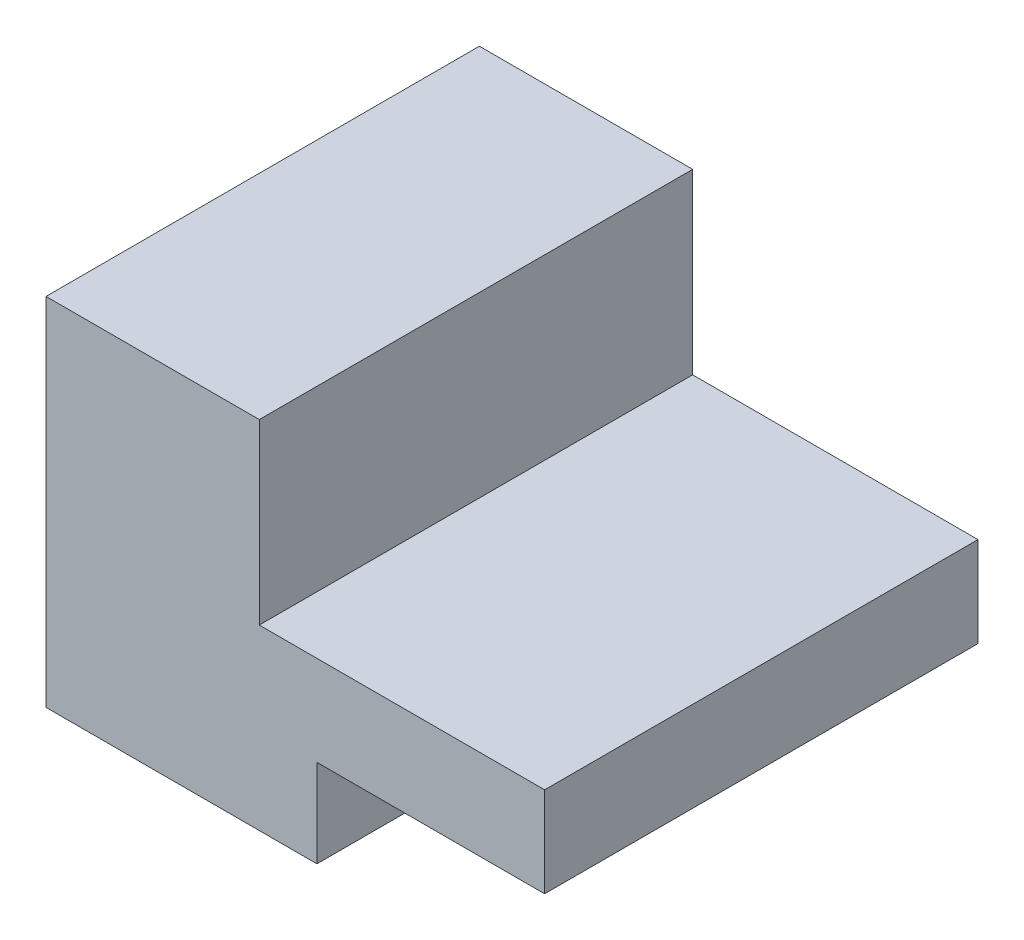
ISO-10303-21;
HEADER;
FILE_DESCRIPTION(('STEP AP214'),'2;1');
FILE_NAME('part.step','',(''),(''),'','','');
FILE_SCHEMA(('AUTOMOTIVE_DESIGN { 1 0 10303 214 1 1 1 1 }'));
ENDSEC;
DATA;
#1=APPLICATION_CONTEXT('core data for automotive mechanical design processes');
#2=APPLICATION_PROTOCOL_DEFINITION('international standard','automotive_design',2000,#1);
#3=PRODUCT_CONTEXT('',#1,'mechanical');
#4=PRODUCT('Part','Part','',(#3));
#5=PRODUCT_RELATED_PRODUCT_CATEGORY('part','',(#4));
#6=PRODUCT_DEFINITION_FORMATION('','',#4);
#7=PRODUCT_DEFINITION_CONTEXT('part definition',#1,'design');
#8=PRODUCT_DEFINITION('design','',#6,#7);
#9=PRODUCT_DEFINITION_SHAPE('','',#8);
#10=(LENGTH_UNIT() NAMED_UNIT(*) SI_UNIT(.MILLI.,.METRE.));
#11=(NAMED_UNIT(*) PLANE_ANGLE_UNIT() SI_UNIT($,.RADIAN.));
#12=(NAMED_UNIT(*) SI_UNIT($,.STERADIAN.) SOLID_ANGLE_UNIT());
#13=UNCERTAINTY_MEASURE_WITH_UNIT(LENGTH_MEASURE(1.E-05),#10,'distance_accuracy_value','');
#14=(GEOMETRIC_REPRESENTATION_CONTEXT(3) GLOBAL_UNCERTAINTY_ASSIGNED_CONTEXT((#13)) GLOBAL_UNIT_ASSIGNED_CONTEXT((#10,
#11,#12)) REPRESENTATION_CONTEXT('',''));
#15=CARTESIAN_POINT('',(0.,0.,0.));
#16=DIRECTION('',(0.,0.,1.));
#17=DIRECTION('',(1.,0.,0.));
#18=AXIS2_PLACEMENT_3D('',#15,#16,#17);
#19=CARTESIAN_POINT('',(-6.70357815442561,0.,42.));
#20=DIRECTION('',(0.,1.,0.));
#21=DIRECTION('',(0.,0.,1.));
#22=AXIS2_PLACEMENT_3D('',#19,#20,#21);
#23=PLANE('',#22);
#24=DIRECTION('',(1.,0.,0.));
#25=VECTOR('',#24,1.);
#26=CARTESIAN_POINT('',(-6.70357815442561,0.,0.));
#27=LINE('',#26,#25);
#28=CARTESIAN_POINT('',(-32.9592592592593,0.,0.));
#29=VERTEX_POINT('',#28);
#30=CARTESIAN_POINT('',(-6.70357815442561,0.,0.));
#31=VERTEX_POINT('',#30);
#32=EDGE_CURVE('E94',#29,#31,#27,.T.);
#33=ORIENTED_EDGE('',*,*,#32,.T.);
#34=DIRECTION('',(0.,0.,-1.));
#35=VECTOR('',#34,1.);
#36=CARTESIAN_POINT('',(-6.70357815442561,0.,42.));
#37=LINE('',#36,#35);
#38=CARTESIAN_POINT('',(-6.70357815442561,0.,42.));
#39=VERTEX_POINT('',#38);
#40=EDGE_CURVE('E11',#39,#31,#37,.T.);
#41=ORIENTED_EDGE('',*,*,#40,.F.);
#42=DIRECTION('',(1.,0.,0.));
#43=VECTOR('',#42,1.);
#44=CARTESIAN_POINT('',(-6.70357815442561,0.,42.));
#45=LINE('',#44,#43);
#46=CARTESIAN_POINT('',(-32.9592592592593,0.,42.));
#47=VERTEX_POINT('',#46);
#48=EDGE_CURVE('E121',#47,#39,#45,.T.);
#49=ORIENTED_EDGE('',*,*,#48,.F.);
#50=DIRECTION('',(0.,0.,-1.));
#51=VECTOR('',#50,1.);
#52=CARTESIAN_POINT('',(-32.9592592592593,0.,42.));
#53=LINE('',#52,#51);
#54=EDGE_CURVE('E107',#47,#29,#53,.T.);
#55=ORIENTED_EDGE('',*,*,#54,.T.);
#56=EDGE_LOOP('',(#33,#41,#49,#55));
#57=FACE_BOUND('',#56,.T.);
#58=ADVANCED_FACE('F26',(#57),#23,.F.);
#59=CARTESIAN_POINT('',(-6.70357815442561,8.51913057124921,42.));
#60=DIRECTION('',(-1.,0.,0.));
#61=DIRECTION('',(0.,0.,1.));
#62=AXIS2_PLACEMENT_3D('',#59,#60,#61);
#63=PLANE('',#62);
#64=DIRECTION('',(0.,1.,0.));
#65=VECTOR('',#64,1.);
#66=CARTESIAN_POINT('',(-6.70357815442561,8.51913057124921,0.));
#67=LINE('',#66,#65);
#68=CARTESIAN_POINT('',(-6.70357815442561,8.51913057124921,0.));
#69=VERTEX_POINT('',#68);
#70=EDGE_CURVE('E90',#31,#69,#67,.T.);
#71=ORIENTED_EDGE('',*,*,#70,.T.);
#72=DIRECTION('',(0.,0.,-1.));
#73=VECTOR('',#72,1.);
#74=CARTESIAN_POINT('',(-6.70357815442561,8.51913057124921,42.));
#75=LINE('',#74,#73);
#76=CARTESIAN_POINT('',(-6.70357815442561,8.51913057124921,42.));
#77=VERTEX_POINT('',#76);
#78=EDGE_CURVE('E33',#77,#69,#75,.T.);
#79=ORIENTED_EDGE('',*,*,#78,.F.);
#80=DIRECTION('',(0.,1.,0.));
#81=VECTOR('',#80,1.);
#82=CARTESIAN_POINT('',(-6.70357815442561,8.51913057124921,42.));
#83=LINE('',#82,#81);
#84=EDGE_CURVE('E103',#39,#77,#83,.T.);
#85=ORIENTED_EDGE('',*,*,#84,.F.);
#86=ORIENTED_EDGE('',*,*,#40,.T.);
#87=EDGE_LOOP('',(#71,#79,#85,#86));
#88=FACE_BOUND('',#87,.T.);
#89=ADVANCED_FACE('F102',(#88),#63,.F.);
#90=CARTESIAN_POINT('',(15.362366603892,8.51913057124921,42.));
#91=DIRECTION('',(0.,1.,0.));
#92=DIRECTION('',(0.,0.,1.));
#93=AXIS2_PLACEMENT_3D('',#90,#91,#92);
#94=PLANE('',#93);
#95=DIRECTION('',(1.,0.,0.));
#96=VECTOR('',#95,1.);
#97=CARTESIAN_POINT('',(15.362366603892,8.51913057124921,0.));
#98=LINE('',#97,#96);
#99=CARTESIAN_POINT('',(15.362366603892,8.51913057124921,0.));
#100=VERTEX_POINT('',#99);
#101=EDGE_CURVE('E96',#69,#100,#98,.T.);
#102=ORIENTED_EDGE('',*,*,#101,.T.);
#103=DIRECTION('',(0.,0.,-1.));
#104=VECTOR('',#103,1.);
#105=CARTESIAN_POINT('',(15.362366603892,8.51913057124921,42.));
#106=LINE('',#105,#104);
#107=CARTESIAN_POINT('',(15.362366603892,8.51913057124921,42.));
#108=VERTEX_POINT('',#107);
#109=EDGE_CURVE('E147',#108,#100,#106,.T.);
#110=ORIENTED_EDGE('',*,*,#109,.F.);
#111=DIRECTION('',(1.,0.,0.));
#112=VECTOR('',#111,1.);
#113=CARTESIAN_POINT('',(15.362366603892,8.51913057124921,42.));
#114=LINE('',#113,#112);
#115=EDGE_CURVE('E124',#77,#108,#114,.T.);
#116=ORIENTED_EDGE('',*,*,#115,.F.);
#117=ORIENTED_EDGE('',*,*,#78,.T.);
#118=EDGE_LOOP('',(#102,#110,#116,#117));
#119=FACE_BOUND('',#118,.T.);
#120=ADVANCED_FACE('F151',(#119),#94,.F.);
#121=CARTESIAN_POINT('',(15.362366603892,17.2477479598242,42.));
#122=DIRECTION('',(-1.,0.,0.));
#123=DIRECTION('',(0.,0.,1.));
#124=AXIS2_PLACEMENT_3D('',#121,#122,#123);
#125=PLANE('',#124);
#126=DIRECTION('',(0.,1.,0.));
#127=VECTOR('',#126,1.);
#128=CARTESIAN_POINT('',(15.362366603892,17.2477479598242,0.));
#129=LINE('',#128,#127);
#130=CARTESIAN_POINT('',(15.362366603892,17.2477479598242,0.));
#131=VERTEX_POINT('',#130);
#132=EDGE_CURVE('E111',#100,#131,#129,.T.);
#133=ORIENTED_EDGE('',*,*,#132,.T.);
#134=DIRECTION('',(0.,0.,-1.));
#135=VECTOR('',#134,1.);
#136=CARTESIAN_POINT('',(15.362366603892,17.2477479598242,42.));
#137=LINE('',#136,#135);
#138=CARTESIAN_POINT('',(15.362366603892,17.2477479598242,42.));
#139=VERTEX_POINT('',#138);
#140=EDGE_CURVE('E144',#139,#131,#137,.T.);
#141=ORIENTED_EDGE('',*,*,#140,.F.);
#142=DIRECTION('',(0.,1.,0.));
#143=VECTOR('',#142,1.);
#144=CARTESIAN_POINT('',(15.362366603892,17.2477479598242,42.));
#145=LINE('',#144,#143);
#146=EDGE_CURVE('E126',#108,#139,#145,.T.);
#147=ORIENTED_EDGE('',*,*,#146,.F.);
#148=ORIENTED_EDGE('',*,*,#109,.T.);
#149=EDGE_LOOP('',(#133,#141,#147,#148));
#150=FACE_BOUND('',#149,.T.);
#151=ADVANCED_FACE('F159',(#150),#125,.F.);
#152=CARTESIAN_POINT('',(-12.2898932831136,17.2477479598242,42.));
#153=DIRECTION('',(0.,-1.,0.));
#154=DIRECTION('',(0.,0.,-1.));
#155=AXIS2_PLACEMENT_3D('',#152,#153,#154);
#156=PLANE('',#155);
#157=DIRECTION('',(-1.,0.,0.));
#158=VECTOR('',#157,1.);
#159=CARTESIAN_POINT('',(-12.2898932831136,17.2477479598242,0.));
#160=LINE('',#159,#158);
#161=CARTESIAN_POINT('',(-12.2898932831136,17.2477479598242,0.));
#162=VERTEX_POINT('',#161);
#163=EDGE_CURVE('E113',#131,#162,#160,.T.);
#164=ORIENTED_EDGE('',*,*,#163,.T.);
#165=DIRECTION('',(0.,0.,-1.));
#166=VECTOR('',#165,1.);
#167=CARTESIAN_POINT('',(-12.2898932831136,17.2477479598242,42.));
#168=LINE('',#167,#166);
#169=CARTESIAN_POINT('',(-12.2898932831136,17.2477479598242,42.));
#170=VERTEX_POINT('',#169);
#171=EDGE_CURVE('E141',#170,#162,#168,.T.);
#172=ORIENTED_EDGE('',*,*,#171,.F.);
#173=DIRECTION('',(-1.,0.,0.));
#174=VECTOR('',#173,1.);
#175=CARTESIAN_POINT('',(-12.2898932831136,17.2477479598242,42.));
#176=LINE('',#175,#174);
#177=EDGE_CURVE('E128',#139,#170,#176,.T.);
#178=ORIENTED_EDGE('',*,*,#177,.F.);
#179=ORIENTED_EDGE('',*,*,#140,.T.);
#180=EDGE_LOOP('',(#164,#172,#178,#179));
#181=FACE_BOUND('',#180,.T.);
#182=ADVANCED_FACE('F162',(#181),#156,.F.);
#183=CARTESIAN_POINT('',(-12.2898932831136,34.4954959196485,42.));
#184=DIRECTION('',(-1.,0.,0.));
#185=DIRECTION('',(0.,0.,1.));
#186=AXIS2_PLACEMENT_3D('',#183,#184,#185);
#187=PLANE('',#186);
#188=DIRECTION('',(0.,1.,0.));
#189=VECTOR('',#188,1.);
#190=CARTESIAN_POINT('',(-12.2898932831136,34.4954959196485,0.));
#191=LINE('',#190,#189);
#192=CARTESIAN_POINT('',(-12.2898932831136,34.4954959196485,0.));
#193=VERTEX_POINT('',#192);
#194=EDGE_CURVE('E115',#162,#193,#191,.T.);
#195=ORIENTED_EDGE('',*,*,#194,.T.);
#196=DIRECTION('',(0.,0.,-1.));
#197=VECTOR('',#196,1.);
#198=CARTESIAN_POINT('',(-12.2898932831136,34.4954959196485,42.));
#199=LINE('',#198,#197);
#200=CARTESIAN_POINT('',(-12.2898932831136,34.4954959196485,42.));
#201=VERTEX_POINT('',#200);
#202=EDGE_CURVE('E138',#201,#193,#199,.T.);
#203=ORIENTED_EDGE('',*,*,#202,.F.);
#204=DIRECTION('',(0.,1.,0.));
#205=VECTOR('',#204,1.);
#206=CARTESIAN_POINT('',(-12.2898932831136,34.4954959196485,42.));
#207=LINE('',#206,#205);
#208=EDGE_CURVE('E130',#170,#201,#207,.T.);
#209=ORIENTED_EDGE('',*,*,#208,.F.);
#210=ORIENTED_EDGE('',*,*,#171,.T.);
#211=EDGE_LOOP('',(#195,#203,#209,#210));
#212=FACE_BOUND('',#211,.T.);
#213=ADVANCED_FACE('F167',(#212),#187,.F.);
#214=CARTESIAN_POINT('',(-32.9592592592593,34.4954959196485,42.));
#215=DIRECTION('',(0.,-1.,0.));
#216=DIRECTION('',(0.,0.,-1.));
#217=AXIS2_PLACEMENT_3D('',#214,#215,#216);
#218=PLANE('',#217);
#219=DIRECTION('',(-1.,0.,0.));
#220=VECTOR('',#219,1.);
#221=CARTESIAN_POINT('',(-32.9592592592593,34.4954959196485,0.));
#222=LINE('',#221,#220);
#223=CARTESIAN_POINT('',(-32.9592592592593,34.4954959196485,0.));
#224=VERTEX_POINT('',#223);
#225=EDGE_CURVE('E117',#193,#224,#222,.T.);
#226=ORIENTED_EDGE('',*,*,#225,.T.);
#227=DIRECTION('',(0.,0.,-1.));
#228=VECTOR('',#227,1.);
#229=CARTESIAN_POINT('',(-32.9592592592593,34.4954959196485,42.));
#230=LINE('',#229,#228);
#231=CARTESIAN_POINT('',(-32.9592592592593,34.4954959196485,42.));
#232=VERTEX_POINT('',#231);
#233=EDGE_CURVE('E135',#232,#224,#230,.T.);
#234=ORIENTED_EDGE('',*,*,#233,.F.);
#235=DIRECTION('',(-1.,0.,0.));
#236=VECTOR('',#235,1.);
#237=CARTESIAN_POINT('',(-32.9592592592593,34.4954959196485,42.));
#238=LINE('',#237,#236);
#239=EDGE_CURVE('E45',#201,#232,#238,.T.);
#240=ORIENTED_EDGE('',*,*,#239,.F.);
#241=ORIENTED_EDGE('',*,*,#202,.T.);
#242=EDGE_LOOP('',(#226,#234,#240,#241));
#243=FACE_BOUND('',#242,.T.);
#244=ADVANCED_FACE('F170',(#243),#218,.F.);
#245=CARTESIAN_POINT('',(-32.9592592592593,0.,42.));
#246=DIRECTION('',(1.,0.,0.));
#247=DIRECTION('',(0.,0.,-1.));
#248=AXIS2_PLACEMENT_3D('',#245,#246,#247);
#249=PLANE('',#248);
#250=DIRECTION('',(0.,-1.,0.));
#251=VECTOR('',#250,1.);
#252=CARTESIAN_POINT('',(-32.9592592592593,0.,0.));
#253=LINE('',#252,#251);
#254=EDGE_CURVE('E119',#224,#29,#253,.T.);
#255=ORIENTED_EDGE('',*,*,#254,.T.);
#256=ORIENTED_EDGE('',*,*,#54,.F.);
#257=DIRECTION('',(0.,-1.,0.));
#258=VECTOR('',#257,1.);
#259=CARTESIAN_POINT('',(-32.9592592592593,0.,42.));
#260=LINE('',#259,#258);
#261=EDGE_CURVE('E40',#232,#47,#260,.T.);
#262=ORIENTED_EDGE('',*,*,#261,.F.);
#263=ORIENTED_EDGE('',*,*,#233,.T.);
#264=EDGE_LOOP('',(#255,#256,#262,#263));
#265=FACE_BOUND('',#264,.T.);
#266=ADVANCED_FACE('F172',(#265),#249,.F.);
#267=CARTESIAN_POINT('',(-32.9592592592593,0.,42.));
#268=DIRECTION('',(0.,0.,-1.));
#269=DIRECTION('',(-1.,0.,0.));
#270=AXIS2_PLACEMENT_3D('',#267,#268,#269);
#271=PLANE('',#270);
#272=ORIENTED_EDGE('',*,*,#48,.T.);
#273=ORIENTED_EDGE('',*,*,#84,.T.);
#274=ORIENTED_EDGE('',*,*,#115,.T.);
#275=ORIENTED_EDGE('',*,*,#146,.T.);
#276=ORIENTED_EDGE('',*,*,#177,.T.);
#277=ORIENTED_EDGE('',*,*,#208,.T.);
#278=ORIENTED_EDGE('',*,*,#239,.T.);
#279=ORIENTED_EDGE('',*,*,#261,.T.);
#280=EDGE_LOOP('',(#272,#273,#274,#275,#276,#277,#278,#279));
#281=FACE_BOUND('',#280,.T.);
#282=ADVANCED_FACE('F154',(#281),#271,.F.);
#283=CARTESIAN_POINT('',(-32.9592592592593,0.,0.));
#284=DIRECTION('',(0.,0.,-1.));
#285=DIRECTION('',(-1.,0.,0.));
#286=AXIS2_PLACEMENT_3D('',#283,#284,#285);
#287=PLANE('',#286);
#288=ORIENTED_EDGE('',*,*,#32,.F.);
#289=ORIENTED_EDGE('',*,*,#254,.F.);
#290=ORIENTED_EDGE('',*,*,#225,.F.);
#291=ORIENTED_EDGE('',*,*,#194,.F.);
#292=ORIENTED_EDGE('',*,*,#163,.F.);
#293=ORIENTED_EDGE('',*,*,#132,.F.);
#294=ORIENTED_EDGE('',*,*,#101,.F.);
#295=ORIENTED_EDGE('',*,*,#70,.F.);
#296=EDGE_LOOP('',(#288,#289,#290,#291,#292,#293,#294,#295));
#297=FACE_BOUND('',#296,.T.);
#298=ADVANCED_FACE('F91',(#297),#287,.T.);
#299=CLOSED_SHELL('',(#58,#89,#120,#151,#182,#213,#244,#266,#282,#298));
#300=MANIFOLD_SOLID_BREP('B2',#299);
#301=ADVANCED_BREP_SHAPE_REPRESENTATION('',(#18,#300),#14);
#302=SHAPE_DEFINITION_REPRESENTATION(#9,#301);
ENDSEC;
END-ISO-10303-21;
